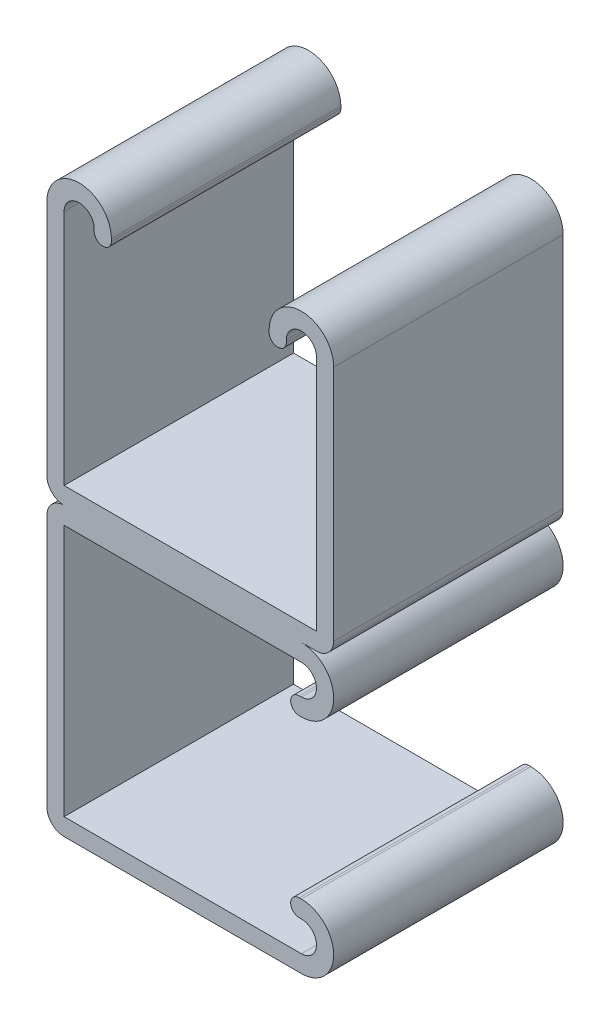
from build123d import *

# Parameters (mm, degrees)
BASE_EXTRUDE_DEPTH = 12.7
CIRPATTERN1_COUNT  = 2
CIRPATTERN1_ANGLE  = 270


with BuildPart() as part:
    # Sketch1 → Base-Extrude (new, symmetric)
    with BuildSketch(Plane.XY):
        with BuildLine():
            Line((0, 28.178125), (0, 1.905))
            ThreePointArc((0, 1.905), (0.557961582, 0.557961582), (1.905, 0))
            Line((1.905, 0), (29.845, 0))
            ThreePointArc((29.845, 0), (31.192038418, 0.557961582), (31.75, 1.905))
            Line((31.75, 1.905), (31.75, 28.178125))
            ThreePointArc((31.75, 28.178125), (28.178125, 31.75), (24.60625, 28.178125))
            Line((24.60625, 28.178125), (24.60625, 27.94))
            ThreePointArc((24.60625, 27.94), (25.55875, 26.9875), (26.51125, 27.94))
            Line((26.51125, 27.94), (26.51125, 28.178125))
            ThreePointArc((26.51125, 28.178125), (28.178125, 29.845), (29.845, 28.178125))
            Line((29.845, 28.178125), (29.845, 1.905))
            Line((29.845, 1.905), (1.905, 1.905))
            Line((1.905, 1.905), (1.905, 28.178125))
            ThreePointArc((1.905, 28.178125), (3.571875, 29.845), (5.23875, 28.178125))
            Line((5.23875, 28.178125), (5.23875, 27.94))
            ThreePointArc((5.23875, 27.94), (6.19125, 26.9875), (7.14375, 27.94))
            Line((7.14375, 27.94), (7.14375, 28.178125))
            ThreePointArc((7.14375, 28.178125), (3.571875, 31.75), (0, 28.178125))
        make_face()
    base_extrude = extrude(amount=BASE_EXTRUDE_DEPTH, both=True)

    # CirPattern1: Base-Extrude ×2 about axis
    cirpattern1_axis = Axis((0, 0, 0), (0, 0, 1))
    for i in range(1, CIRPATTERN1_COUNT):
        add(base_extrude.rotate(cirpattern1_axis, i * CIRPATTERN1_ANGLE / (CIRPATTERN1_COUNT - 1)))


solid = part.part
